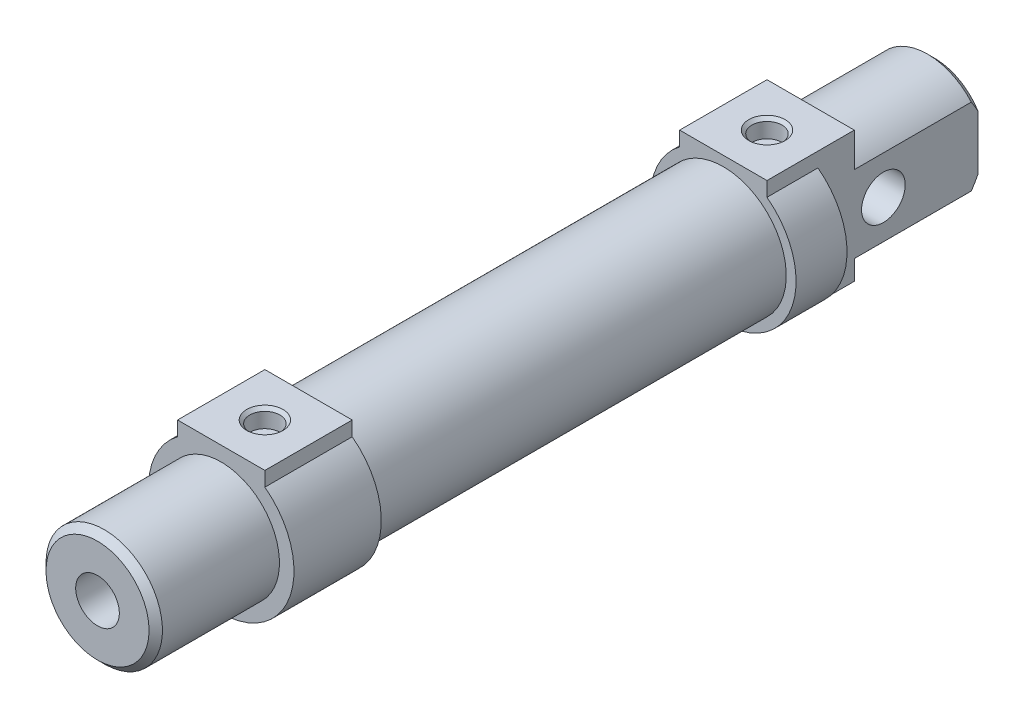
from build123d import *

# Parameters (mm, degrees)
LINEAR_AUSTRAGEN1_DEPTH      = 20
LINEAR_AUSTRAGEN1_DEPTH_BACK = 20
SKIZZE3_W                    = 12
SKIZZE3_H                    = 12
LINEAR_AUSTRAGEN2_DEPTH      = 10
SKIZZE4_W                    = 12
SKIZZE4_H                    = 12
LINEAR_AUSTRAGEN3_DEPTH      = 10
LINEAR_AUSTRAGEN4_DEPTH      = 20
LINEAR_AUSTRAGEN4_DEPTH_BACK = 20
SKIZZE8_R                    = 3


with BuildPart() as part:
    # Skizze1 → Rotation1 (revolve)
    with BuildSketch(Plane(origin=(0, 0, 0), x_dir=(0, 0, -1), z_dir=(1, 0, 0)), mode=Mode.PRIVATE) as rotation1_sk:
        Polygon((-17, 0), (-17, 7.08), (-16.08, 8), (0, 8), (0, 10), (12, 10), (12, 8.65), (69, 8.65), (69, 10), (81, 10), (81, 8), (97.08, 8), (98, 7.08), (98, 0), align=None)
    revolve(rotation1_sk.sketch.rotate(Axis((0, 0, -98), (0, 0, 1)), 90), axis=Axis((0, 0, -98), (0, 0, 1)))

    # Skizze2 → Linear austragen1 (cut, two sides: drawn at the far end of the back side and taken through both)
    with BuildSketch(Plane(origin=(0, 0, 0), x_dir=(-1, 0, 0), z_dir=(0, 1, 0)).offset(-LINEAR_AUSTRAGEN1_DEPTH_BACK)):
        Polygon((26, -76), (6, -76), (6, -99), (-6, -99), (-6, -76), (-26, -76), (-26, -119), (26, -119), align=None)
    extrude(amount=LINEAR_AUSTRAGEN1_DEPTH + LINEAR_AUSTRAGEN1_DEPTH_BACK, mode=Mode.SUBTRACT)

    # Skizze3 → Linear austragen2 (add)
    with BuildSketch(Plane(origin=(0, 0, 0), x_dir=(-1, 0, 0), z_dir=(0, 1, 0))):
        with Locations((0, -6)):
            Rectangle(SKIZZE3_W, SKIZZE3_H)
    extrude(amount=LINEAR_AUSTRAGEN2_DEPTH)

    # Skizze4 → Linear austragen3 (add)
    with BuildSketch(Plane(origin=(0, 0, 0), x_dir=(-1, 0, 0), z_dir=(0, 1, 0))):
        with Locations((0, -75)):
            Rectangle(SKIZZE4_W, SKIZZE4_H)
    extrude(amount=LINEAR_AUSTRAGEN3_DEPTH)

    # Skizze5 → Schnitt-Rotation1 (revolve, cut)
    with BuildSketch(Plane(origin=(0, 0, 0), x_dir=(0, 0, -1), z_dir=(1, 0, 0))):
        Polygon((6, 10), (8.5, 10), (8.067, 9.567), (8.067, 7.5), (6, 7.5), align=None)
    revolve(axis=Axis((0, 7.5, -6), (0, 1, 0)), mode=Mode.SUBTRACT)

    # Skizze6 → Schnitt-Rotation2 (revolve, cut)
    with BuildSketch(Plane(origin=(0, 0, 0), x_dir=(0, 0, -1), z_dir=(1, 0, 0))):
        Polygon((75, 10), (77.5, 10), (77.067, 9.567), (77.067, 7.5), (75, 7.5), align=None)
    revolve(axis=Axis((0, 7.5, -75), (0, 1, 0)), mode=Mode.SUBTRACT)

    # Skizze7 → Schnitt-Rotation3 (revolve, cut)
    with BuildSketch(Plane(origin=(0, 0, 0), x_dir=(0, 0, -1), z_dir=(1, 0, 0)), mode=Mode.PRIVATE) as schnitt_rotation3_sk:
        Polygon((-17, 0), (-17, 3), (35, 3), (35, 8), (64, 8), (64, 0), align=None)
    revolve(schnitt_rotation3_sk.sketch.rotate(Axis((0, 0, -64), (0, 0, 1)), 270), axis=Axis((0, 0, -64), (0, 0, 1)), mode=Mode.SUBTRACT)

    # Skizze8 → Linear austragen4 (cut, two sides: drawn at the far end of the back side and taken through both)
    with BuildSketch(Plane(origin=(0, 0, 0), x_dir=(0, 0, -1), z_dir=(1, 0, 0)).offset(-LINEAR_AUSTRAGEN4_DEPTH_BACK)):
        with Locations(Location((85, 0, 0), (0, 0, 180))):
            Circle(SKIZZE8_R)
    extrude(amount=LINEAR_AUSTRAGEN4_DEPTH + LINEAR_AUSTRAGEN4_DEPTH_BACK, mode=Mode.SUBTRACT)


solid = part.part
